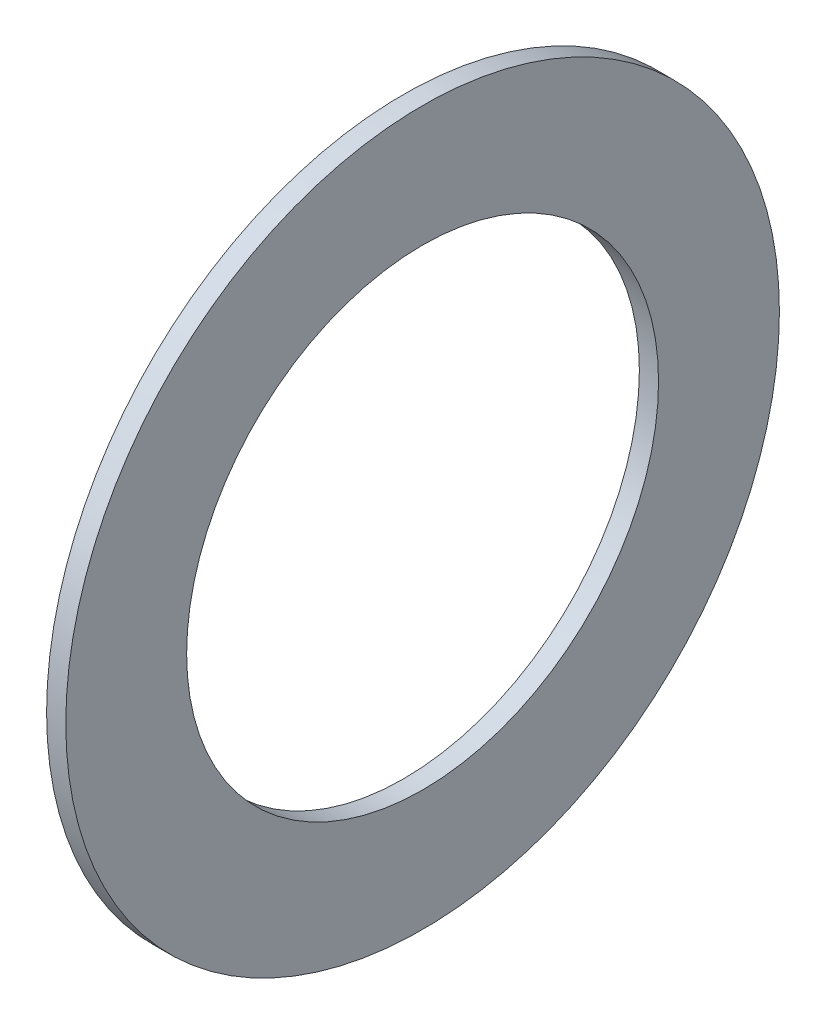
from build123d import *

# Parameters (mm, degrees)
ESQUISSE1_W = 1
ESQUISSE1_H = 6.3


with BuildPart() as part:
    # Esquisse1 → Base-R_volution (revolve)
    with BuildSketch(Plane.XY, mode=Mode.PRIVATE) as base_r_volution_sk:
        with Locations((-0.5, 15.45)):
            Rectangle(ESQUISSE1_W, ESQUISSE1_H)
    revolve(base_r_volution_sk.sketch.rotate(Axis((-10.625070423, 0, 0), (1, 0, 0)), 90), axis=Axis((-10.625070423, 0, 0), (1, 0, 0)))


solid = part.part
